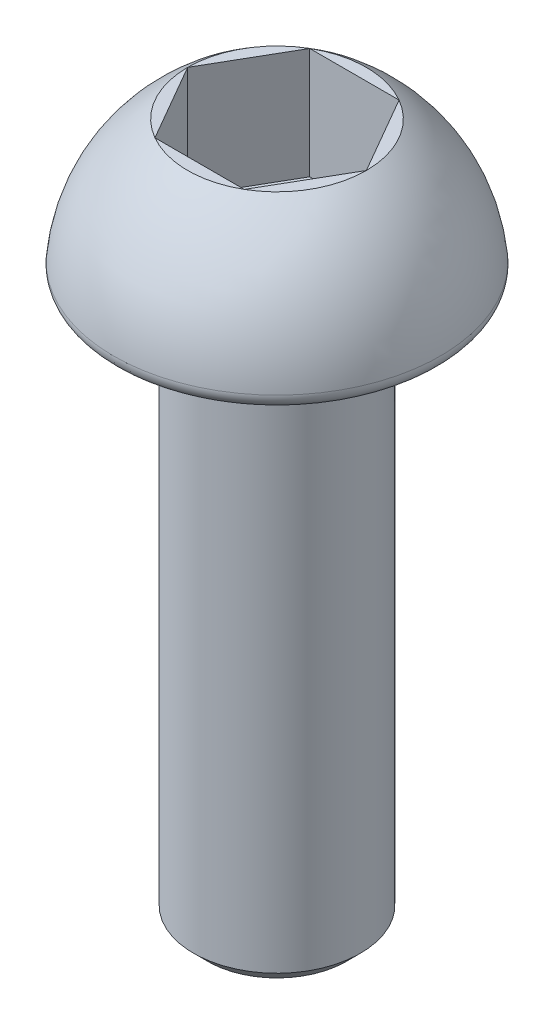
from build123d import *

# Parameters (mm, degrees)
ENL_V_MAT_EXTRU_1_DEPTH = 4
CHANFREIN1_SIZE         = 0.5


with BuildPart() as part:
    # Esquisse2 → Base-R_volution (revolve)
    with BuildSketch(Plane.XY, mode=Mode.PRIVATE) as base_r_volution_sk:
        with BuildLine():
            Line((5.375577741, 43.708568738), (3, 43.708568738))
            Line((3, 43.708568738), (3, 23.708568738))
            Line((3, 23.708568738), (0, 23.708568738))
            Line((0, 23.708568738), (0, 48.708568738))
            Line((0, 48.708568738), (3.214976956, 48.708568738))
            ThreePointArc((3.214976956, 48.708568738), (5.05053981, 46.783461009), (5.873507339, 44.254023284))
            ThreePointArc((5.873507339, 44.254023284), (5.744852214, 43.871468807), (5.375577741, 43.708568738))
        make_face()
    revolve(base_r_volution_sk.sketch.rotate(Axis((0, 0, 0), (0, 1, 0)), 90), axis=Axis((0, 0, 0), (0, 1, 0)))

    # Esquisse3 → Enl_v. mat.-Extru.1 (cut)
    with BuildSketch(Plane(origin=(0, 48.708568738, 0), x_dir=(-1, 0, 0), z_dir=(0, 1, 0))):
        Polygon((-3.214976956, 0), (-1.607488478, 2.784251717), (1.607488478, 2.784251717), (3.214976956, 0), (1.607488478, -2.784251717), (-1.607488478, -2.784251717), align=None)
    extrude(amount=-ENL_V_MAT_EXTRU_1_DEPTH, mode=Mode.SUBTRACT)

    # Chanfrein1
    chanfrein1_edges = [part.edges().sort_by_distance(p)[0] for p in [
        (0, 23.708568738, 3),
    ]]
    chamfer(chanfrein1_edges, length=CHANFREIN1_SIZE)


solid = part.part
